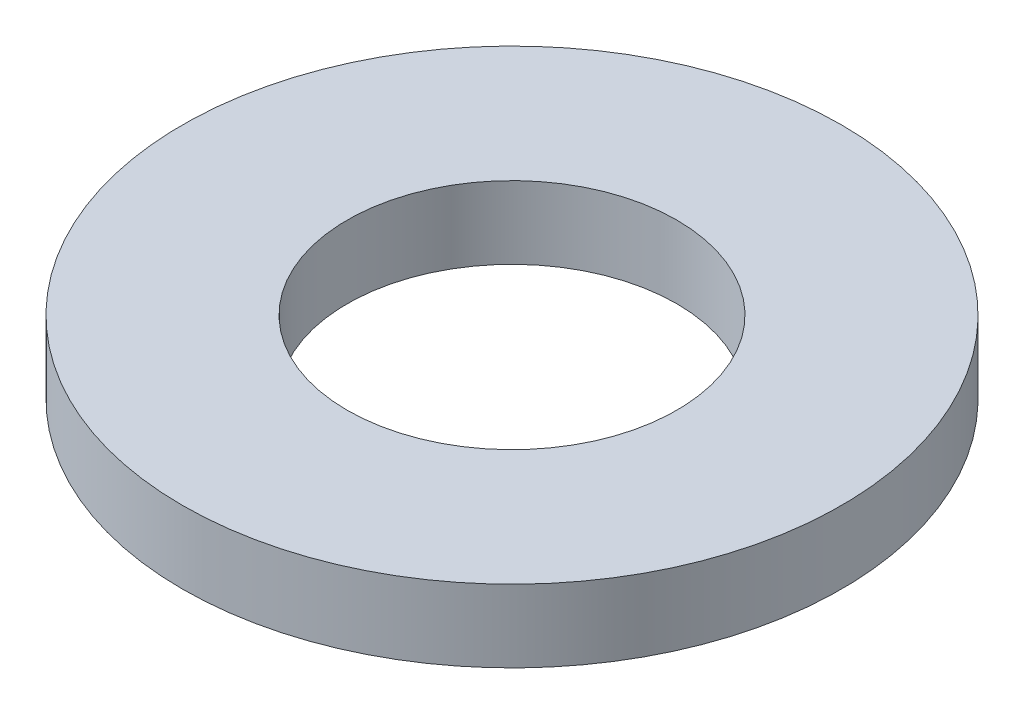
from build123d import *

# Parameters (mm, degrees)
ESQUISSE1_W = 5
ESQUISSE1_H = 2.2


with BuildPart() as part:
    # Esquisse1 → Base (revolve)
    with BuildSketch(Plane.XY, mode=Mode.PRIVATE) as base_sk:
        with Locations((7.5, 1.1)):
            Rectangle(ESQUISSE1_W, ESQUISSE1_H)
    revolve(base_sk.sketch.rotate(Axis((0, 0, 0), (0, 1, 0)), 90), axis=Axis((0, 0, 0), (0, 1, 0)))


solid = part.part
